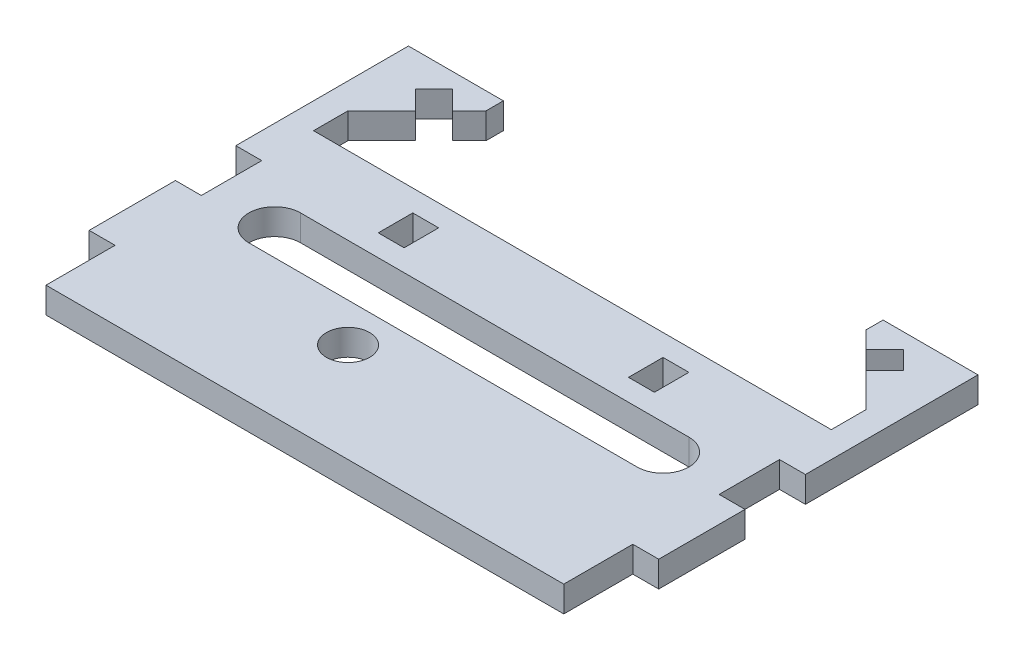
from build123d import *

# Parameters (mm, degrees)
SKETCH1_W           = 60
SKETCH1_H           = 36
BOSS_EXTRUDE1_DEPTH = 3
SKETCH2_R           = 2.5
CUT_EXTRUDE1_DEPTH  = 3
SKETCH3_W           = 3
SKETCH3_H           = 10
BOSS_EXTRUDE2_DEPTH = 3
SKETCH4_W           = 60
SKETCH4_H           = 5
CUT_EXTRUDE2_DEPTH  = 3
BOSS_EXTRUDE3_DEPTH = 3
CUT_EXTRUDE3_DEPTH  = 3
CUT_EXTRUDE4_REACH  = 44.743
SKETCH7_W           = 3
SKETCH7_H           = 4


with BuildPart() as part:
    # Sketch1 → Boss-Extrude1 (new body)
    with BuildSketch(Plane(origin=(0, 0, 0), x_dir=(1, 0, 0), z_dir=(0, 1, 0))):
        Rectangle(SKETCH1_W, SKETCH1_H)
    extrude(amount=BOSS_EXTRUDE1_DEPTH)

    # Sketch2 → Cut-Extrude1 (cut)
    with BuildSketch(Plane(origin=(0, 0, 0), x_dir=(1, 0, 0), z_dir=(0, 1, 0))):
        with Locations(Location((-6.5, -6.5, 0), (0, 0, 270))):
            Circle(SKETCH2_R)
    extrude(amount=CUT_EXTRUDE1_DEPTH, mode=Mode.SUBTRACT)

    # Sketch3 → Boss-Extrude2 (add)
    with BuildSketch(Plane(origin=(0, 0, 0), x_dir=(1, 0, 0), z_dir=(0, 1, 0))):
        with Locations((-31.5, -5)):
            Rectangle(SKETCH3_W, SKETCH3_H)
        with Locations((31.5, -5)):
            Rectangle(SKETCH3_W, SKETCH3_H)
    extrude(amount=BOSS_EXTRUDE2_DEPTH)

    # Sketch4 → Cut-Extrude2 (cut)
    with BuildSketch(Plane(origin=(0, 0, 0), x_dir=(1, 0, 0), z_dir=(0, 1, 0))):
        with Locations((0, 15.5)):
            Rectangle(SKETCH4_W, SKETCH4_H)
    extrude(amount=CUT_EXTRUDE2_DEPTH, mode=Mode.SUBTRACT)

    # Sketch5 → Boss-Extrude3 (add)
    with BuildSketch(Plane(origin=(0, 0, 0), x_dir=(1, 0, 0), z_dir=(0, 1, 0))):
        Polygon((-33, 7), (-33, 27), (-22, 27), (-22, 25), (-30, 17), (-30, 13), (-30, 7), align=None)
        Polygon((30, 7), (30, 13), (30, 17), (22, 25), (22, 27), (33, 27), (33, 7), align=None)
    extrude(amount=BOSS_EXTRUDE3_DEPTH)

    # Sketch6 → Cut-Extrude3 (cut)
    with BuildSketch(Plane(origin=(0, 0, 0), x_dir=(1, 0, 0), z_dir=(0, 1, 0))):
        Polygon((-28.27314934, 23.110912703), (-26.081118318, 20.918881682), (-23.959797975, 23.040202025), (-26.151828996, 25.232233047), align=None)
        Polygon((26.151828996, 25.232233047), (23.959797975, 23.040202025), (26.081118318, 20.918881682), (28.27314934, 23.110912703), align=None)
    extrude(amount=CUT_EXTRUDE3_DEPTH, mode=Mode.SUBTRACT)

    # Sketch7 → Cut-Extrude4 (cut, up to next)
    with BuildSketch(Plane(origin=(0, 0, 0), x_dir=(1, 0, 0), z_dir=(0, 1, 0)), mode=Mode.PRIVATE) as cut_extrude4_sk1:
        with BuildLine():
            Line((-22.5, 4), (22.5, 4))
            ThreePointArc((22.5, 4), (25.5, 1), (22.5, -2))
            Line((22.5, -2), (-22.5, -2))
            ThreePointArc((-22.5, -2), (-25.5, 1), (-22.5, 4))
        make_face()
    cut_extrude4_tool1 = extrude(cut_extrude4_sk1.sketch, amount=CUT_EXTRUDE4_REACH, mode=Mode.PRIVATE) & part.part
    # Sketch7 → Cut-Extrude4 (cut, up to next)
    with BuildSketch(Plane(origin=(0, 0, 0), x_dir=(1, 0, 0), z_dir=(0, 1, 0)), mode=Mode.PRIVATE) as cut_extrude4_sk2:
        with Locations((14.5, 8.5)):
            Rectangle(SKETCH7_W, SKETCH7_H)
    cut_extrude4_tool2 = extrude(cut_extrude4_sk2.sketch, amount=CUT_EXTRUDE4_REACH, mode=Mode.PRIVATE) & part.part
    # Sketch7 → Cut-Extrude4 (cut, up to next)
    with BuildSketch(Plane(origin=(0, 0, 0), x_dir=(1, 0, 0), z_dir=(0, 1, 0)), mode=Mode.PRIVATE) as cut_extrude4_sk3:
        with Locations((-14.5, 8.5)):
            Rectangle(SKETCH7_W, SKETCH7_H)
    cut_extrude4_tool3 = extrude(cut_extrude4_sk3.sketch, amount=CUT_EXTRUDE4_REACH, mode=Mode.PRIVATE) & part.part
    add(cut_extrude4_tool1.solids().sort_by_distance((0, 0, -1))[0], mode=Mode.SUBTRACT)
    add(cut_extrude4_tool2.solids().sort_by_distance((14.5, 0, -8.5))[0], mode=Mode.SUBTRACT)
    add(cut_extrude4_tool3.solids().sort_by_distance((-14.5, 0, -8.5))[0], mode=Mode.SUBTRACT)


solid = part.part
